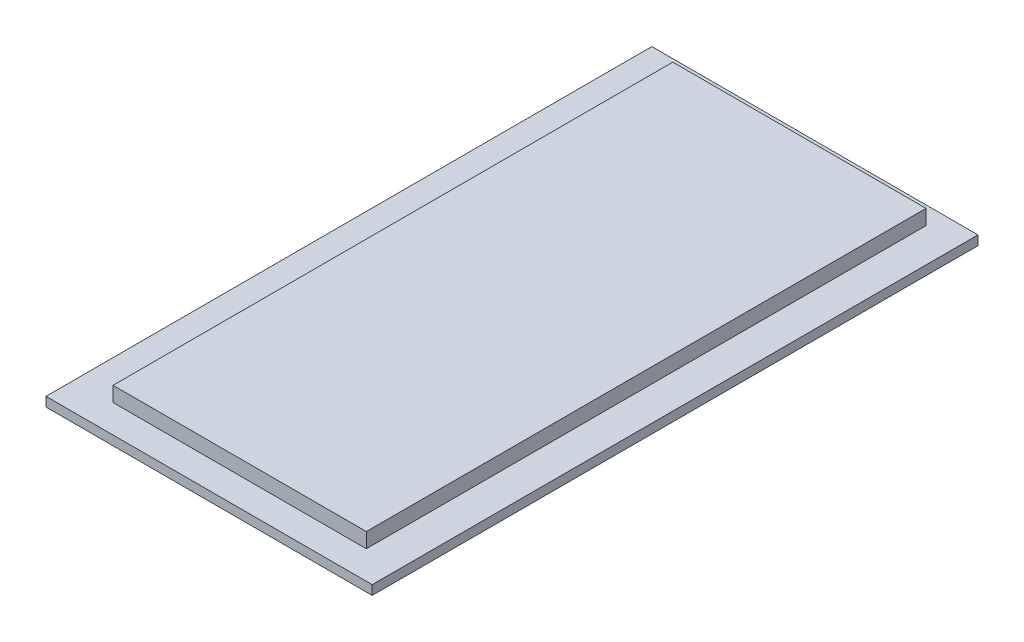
from build123d import *

# Parameters (mm, degrees)
SKETCH1_W           = 88.9
SKETCH1_H           = 165.1
BOSS_EXTRUDE1_DEPTH = 2.54
SKETCH2_W           = 69.026498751
SKETCH2_H           = 152.550209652
BOSS_EXTRUDE2_DEPTH = 4.064


with BuildPart() as part:
    # Sketch1 → Boss-Extrude1 (new body)
    with BuildSketch(Plane(origin=(0, 0, 0), x_dir=(1, 0, 0), z_dir=(0, 1, 0))):
        with Locations((44.45, 82.55)):
            Rectangle(SKETCH1_W, SKETCH1_H)
    extrude(amount=BOSS_EXTRUDE1_DEPTH)

    # Sketch2 → Boss-Extrude2 (add)
    with BuildSketch(Plane(origin=(0, 2.54, 0), x_dir=(1, 0, 0), z_dir=(0, 1, 0))):
        with Locations((45.108964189, 83.950298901)):
            Rectangle(SKETCH2_W, SKETCH2_H)
    extrude(amount=BOSS_EXTRUDE2_DEPTH)


solid = part.part
